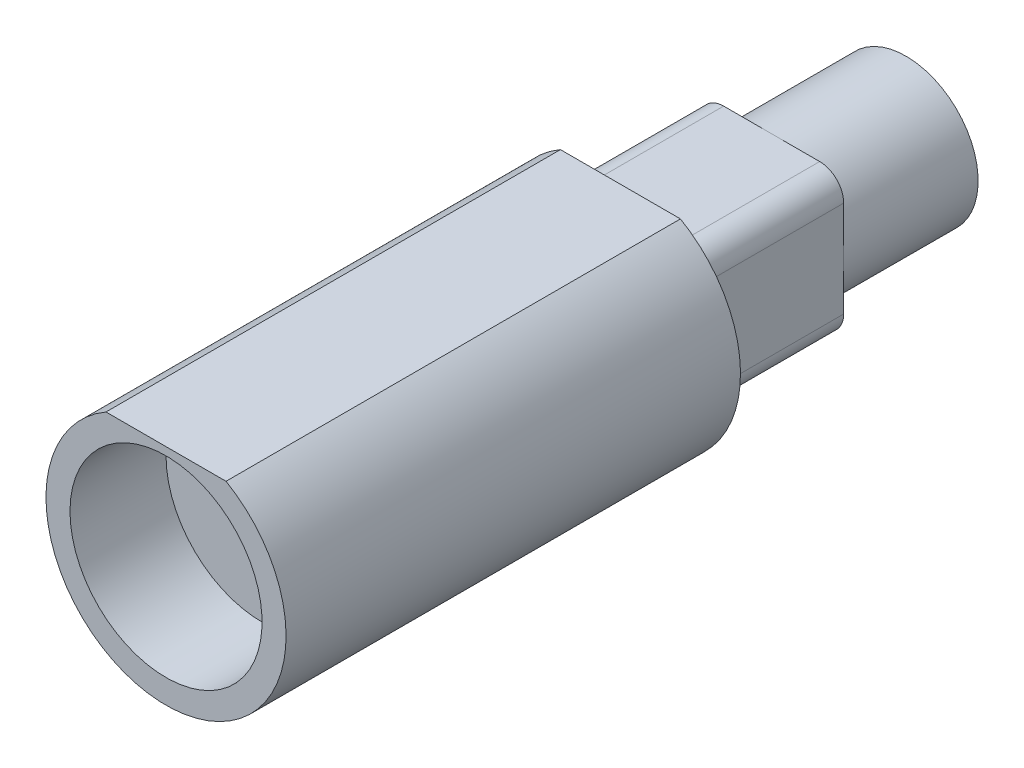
from build123d import *

# Parameters (mm, degrees)
BOSS_EXTRUDE2_DEPTH      = 152.4
BOSS_EXTRUDE2_DEPTH_BACK = 152.4
SKETCH3_R                = 7.9375
CUT_EXTRUDE5_DEPTH       = 153.812852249
CUT_EXTRUDE5_DEPTH_BACK  = 153.812852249
CHAMFER1_SIZE            = 0.79375
SKETCH11_W               = 23.25976677
SKETCH11_H               = 18.130678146
SKETCH11_R               = 4.7625
CUT_EXTRUDE6_DEPTH       = 6.35
SKETCH14_W               = 30.647529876
SKETCH14_H               = 27.901420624
SKETCH14_W_2             = 9.525
SKETCH14_H_2             = 9.525
CUT_EXTRUDE7_DEPTH       = 10
FILLET6_R                = 1.5875
BOSS_EXTRUDE3_START      = 2.54
SKETCH17_R               = 4.7625
BOSS_EXTRUDE3_DEPTH      = 2.54


with BuildPart() as part:
    # Sketch3 → Boss-Extrude2 (new, two sides: drawn at the far end of the back side and taken through both)
    with BuildSketch(Plane.XY.offset(-BOSS_EXTRUDE2_DEPTH_BACK)):
        with Locations(Location((0, 0, 0), (0, 0, 180))):
            Circle(SKETCH3_R)
    extrude(amount=BOSS_EXTRUDE2_DEPTH + BOSS_EXTRUDE2_DEPTH_BACK)

    # Sketch10 → Cut-Extrude5 (cut, two sides: drawn at the far end of the back side and taken through both)
    with BuildSketch(Plane.XY.offset(-CUT_EXTRUDE5_DEPTH_BACK)):
        with BuildLine():
            Line((-3.96875, 6.874076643), (3.96875, 6.874076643))
            ThreePointArc((3.96875, 6.874076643), (0, 7.9375), (-3.96875, 6.874076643))
        make_face()
    extrude(amount=CUT_EXTRUDE5_DEPTH + CUT_EXTRUDE5_DEPTH_BACK, mode=Mode.SUBTRACT)

    # Chamfer1
    chamfer1_edges = [part.edges().sort_by_distance(p)[0] for p in [
        (0, -7.9375, -152.4),
        (0, -7.9375, 152.4),
    ]]
    chamfer(chamfer1_edges, length=CHAMFER1_SIZE)

    # Sketch11 → Cut-Extrude6 (cut)
    with BuildSketch(Plane(origin=(0, 0, -152.4), x_dir=(-1, 0, 0), z_dir=(0, 0, -1))):
        Rectangle(SKETCH11_W, SKETCH11_H)
        Circle(SKETCH11_R, mode=Mode.SUBTRACT)
    extrude(amount=-CUT_EXTRUDE6_DEPTH, mode=Mode.SUBTRACT)

    # Sketch14 → Cut-Extrude7 (cut)
    with BuildSketch(Plane(origin=(0, 0, -146.05), x_dir=(-1, 0, 0), z_dir=(0, 0, -1))):
        Rectangle(SKETCH14_W, SKETCH14_H)
        Rectangle(SKETCH14_W_2, SKETCH14_H_2, mode=Mode.SUBTRACT)
    extrude(amount=-CUT_EXTRUDE7_DEPTH, mode=Mode.SUBTRACT)

    # Sketch15 → Cut-Revolve1 (revolve, cut)
    with BuildSketch(Plane(origin=(0, 0, 0), x_dir=(1, 0, 0), z_dir=(0, 1, 0))):
        Polygon((-7.9375, 106.00145424), (-7.9375, -174.219250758), (0, -174.219250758), (0, 112.35145424), (-6.35, 112.35145424), (-6.35, 106.00145424), align=None)
    revolve(axis=Axis((0, 0, 0), (0, 0, 1)), mode=Mode.SUBTRACT)

    # Fillet6
    fillet6_edges = [part.edges().sort_by_distance(p)[0] for p in [
        (-4.7625, -4.7625, -141.05),
        (4.7625, -4.7625, -141.05),
        (4.7625, 4.7625, -141.05),
        (-4.7625, 4.7625, -141.05),
    ]]
    fillet(fillet6_edges, radius=FILLET6_R)

    # Sketch17 → Boss-Extrude3 (add)
    with BuildSketch(Plane(origin=(0, 0, -152.4), x_dir=(-1, 0, 0), z_dir=(0, 0, -1)).offset(BOSS_EXTRUDE3_START)):
        Circle(SKETCH17_R)
    extrude(amount=-BOSS_EXTRUDE3_DEPTH)


solid = part.part
